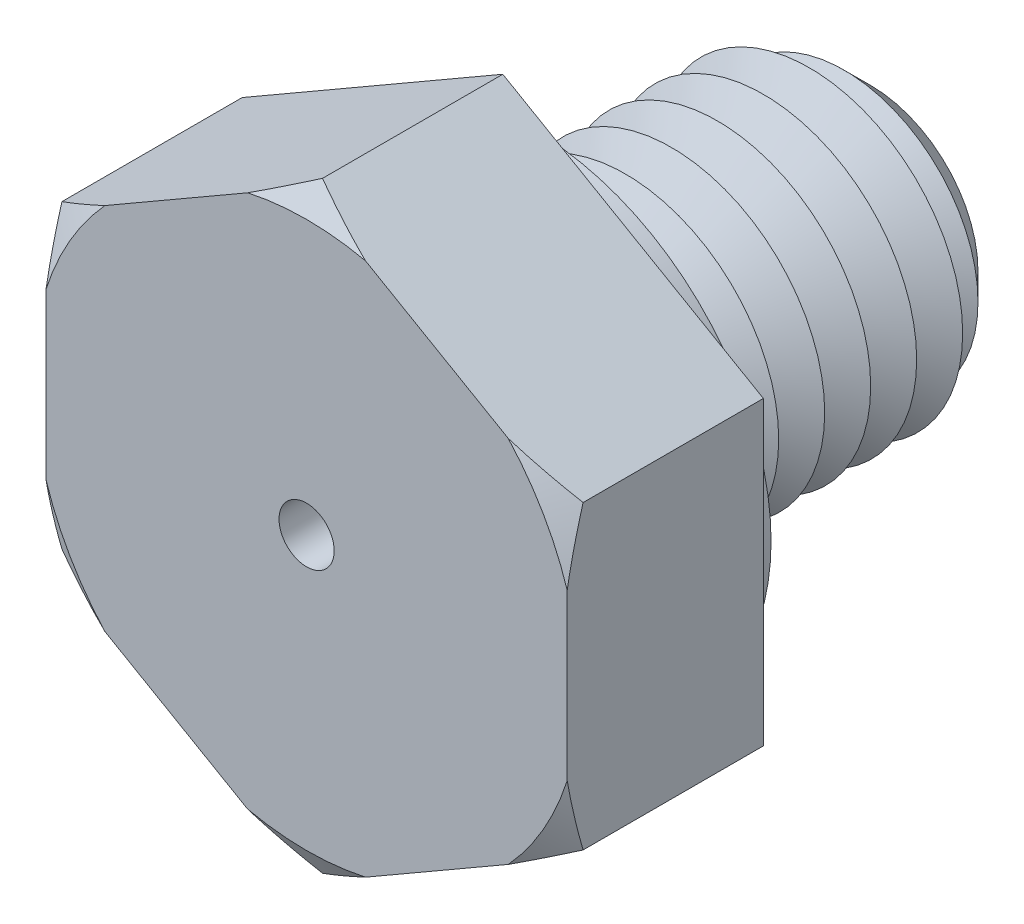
from build123d import *

# Parameters (mm, degrees)
BOSS_EXTRUDE1_DEPTH = 6.4
SKETCH3_R           = 5
BOSS_EXTRUDE2_DEPTH = 12
SKETCH4_R           = 7.75
BOSS_EXTRUDE3_DEPTH = 1
CHAMFER1_SIZE       = 1.5
LPATTERN1_COUNT     = 7
LPATTERN1_PITCH     = 1.5
SKETCH8_R           = 0.9
CUT_EXTRUDE1_DEPTH  = 18.4


with BuildPart() as part:
    # Sketch2 → Boss-Extrude1 (new body)
    with BuildSketch(Plane.XY):
        Polygon((0, 9.814954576), (-8.5, 4.907477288), (-8.5, -4.907477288), (0, -9.814954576), (8.5, -4.907477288), (8.5, 4.907477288), align=None)
    extrude(amount=BOSS_EXTRUDE1_DEPTH)

    # Sketch3 → Boss-Extrude2 (add)
    with BuildSketch(Plane(origin=(0, 0, 0), x_dir=(-1, 0, 0), z_dir=(0, 0, -1))):
        Circle(SKETCH3_R)
    extrude(amount=BOSS_EXTRUDE2_DEPTH)

    # Sketch4 → Boss-Extrude3 (add)
    with BuildSketch(Plane(origin=(0, 0, 0), x_dir=(-1, 0, 0), z_dir=(0, 0, -1))):
        with Locations(Location((0, 0, 0), (0, 0, 180))):
            Circle(SKETCH4_R)
    extrude(amount=BOSS_EXTRUDE3_DEPTH)

    # Chamfer1
    chamfer1_edges = [part.edges().sort_by_distance(p)[0] for p in [
        (5, 0, -12),
    ]]
    chamfer(chamfer1_edges, length=CHAMFER1_SIZE)

    # Sketch6 → Cut-Revolve1 (revolve, cut)
    with BuildSketch(Plane(origin=(0, 0, 0), x_dir=(0, 0, -1), z_dir=(1, 0, 0)), mode=Mode.PRIVATE) as cut_revolve1_sk:
        Polygon((1, 5), (1.75, 3.700961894), (2.5, 5), align=None)
    cut_revolve1 = revolve(cut_revolve1_sk.sketch.rotate(Axis((0, 0, 3.211670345), (0, 0, -1)), 90), axis=Axis((0, 0, 3.211670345), (0, 0, -1)), mode=Mode.SUBTRACT)

    # LPattern1: Cut-Revolve1 ×7
    with Locations(*[(0, 0, -i * LPATTERN1_PITCH) for i in range(1, LPATTERN1_COUNT)]):
        add(cut_revolve1, mode=Mode.SUBTRACT)

    # Sketch7 → Cut-Revolve2 (revolve, cut)
    with BuildSketch(Plane(origin=(0, 0, 0), x_dir=(0, 0, -1), z_dir=(1, 0, 0)), mode=Mode.PRIVATE) as cut_revolve2_sk:
        Polygon((-6.4, 9.814954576), (-6.4, 8.914954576), (-5.880384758, 9.814954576), align=None)
    revolve(cut_revolve2_sk.sketch.rotate(Axis((0, 0, 3.211670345), (0, 0, -1)), 270), axis=Axis((0, 0, 3.211670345), (0, 0, -1)), mode=Mode.SUBTRACT)

    # Sketch8 → Cut-Extrude1 (cut)
    with BuildSketch(Plane.XY.offset(6.4)):
        Circle(SKETCH8_R)
    extrude(amount=-CUT_EXTRUDE1_DEPTH, mode=Mode.SUBTRACT)


solid = part.part
